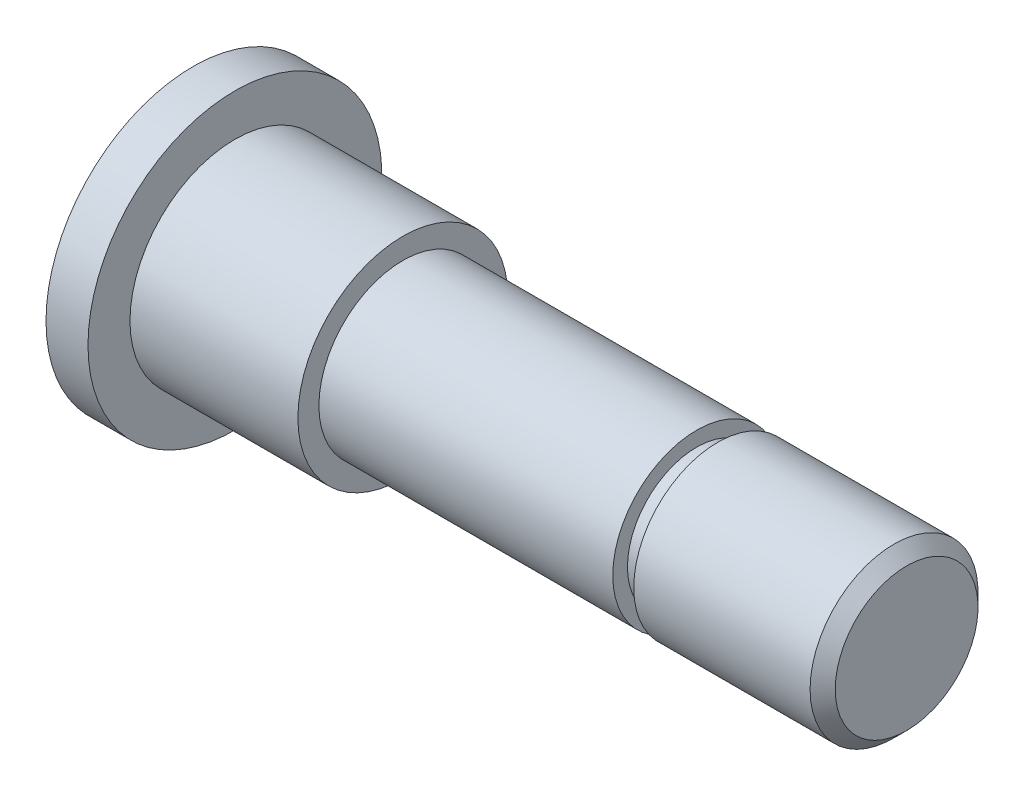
ISO-10303-21;
HEADER;
FILE_DESCRIPTION(('STEP AP214'),'2;1');
FILE_NAME('part.step','',(''),(''),'','','');
FILE_SCHEMA(('AUTOMOTIVE_DESIGN { 1 0 10303 214 1 1 1 1 }'));
ENDSEC;
DATA;
#1=APPLICATION_CONTEXT('core data for automotive mechanical design processes');
#2=APPLICATION_PROTOCOL_DEFINITION('international standard','automotive_design',2000,#1);
#3=PRODUCT_CONTEXT('',#1,'mechanical');
#4=PRODUCT('Part','Part','',(#3));
#5=PRODUCT_RELATED_PRODUCT_CATEGORY('part','',(#4));
#6=PRODUCT_DEFINITION_FORMATION('','',#4);
#7=PRODUCT_DEFINITION_CONTEXT('part definition',#1,'design');
#8=PRODUCT_DEFINITION('design','',#6,#7);
#9=PRODUCT_DEFINITION_SHAPE('','',#8);
#10=(LENGTH_UNIT() NAMED_UNIT(*) SI_UNIT(.MILLI.,.METRE.));
#11=(NAMED_UNIT(*) PLANE_ANGLE_UNIT() SI_UNIT($,.RADIAN.));
#12=(NAMED_UNIT(*) SI_UNIT($,.STERADIAN.) SOLID_ANGLE_UNIT());
#13=UNCERTAINTY_MEASURE_WITH_UNIT(LENGTH_MEASURE(1.E-05),#10,'distance_accuracy_value','');
#14=(GEOMETRIC_REPRESENTATION_CONTEXT(3) GLOBAL_UNCERTAINTY_ASSIGNED_CONTEXT((#13)) GLOBAL_UNIT_ASSIGNED_CONTEXT((#10,
#11,#12)) REPRESENTATION_CONTEXT('',''));
#15=CARTESIAN_POINT('',(0.,0.,0.));
#16=DIRECTION('',(0.,0.,1.));
#17=DIRECTION('',(1.,0.,0.));
#18=AXIS2_PLACEMENT_3D('',#15,#16,#17);
#19=CARTESIAN_POINT('',(0.,0.,0.));
#20=DIRECTION('',(1.,0.,0.));
#21=DIRECTION('',(0.,0.,-1.));
#22=AXIS2_PLACEMENT_3D('',#19,#20,#21);
#23=PLANE('',#22);
#24=CARTESIAN_POINT('',(0.,0.,0.));
#25=DIRECTION('',(-1.,0.,0.));
#26=DIRECTION('',(0.,0.,1.));
#27=AXIS2_PLACEMENT_3D('',#24,#25,#26);
#28=CIRCLE('',#27,7.);
#29=CARTESIAN_POINT('',(0.,0.,7.));
#30=VERTEX_POINT('',#29);
#31=EDGE_CURVE('E40',#30,#30,#28,.T.);
#32=ORIENTED_EDGE('',*,*,#31,.T.);
#33=EDGE_LOOP('',(#32));
#34=FACE_BOUND('',#33,.T.);
#35=ADVANCED_FACE('F30',(#34),#23,.F.);
#36=CARTESIAN_POINT('',(-12.5747225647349,0.,0.));
#37=DIRECTION('',(-1.,0.,0.));
#38=DIRECTION('',(0.,0.,1.));
#39=AXIS2_PLACEMENT_3D('',#36,#37,#38);
#40=CYLINDRICAL_SURFACE('',#39,7.);
#41=ORIENTED_EDGE('',*,*,#31,.F.);
#42=EDGE_LOOP('',(#41));
#43=FACE_BOUND('',#42,.T.);
#44=CARTESIAN_POINT('',(2.,0.,0.));
#45=DIRECTION('',(-1.,0.,0.));
#46=DIRECTION('',(0.,0.,1.));
#47=AXIS2_PLACEMENT_3D('',#44,#45,#46);
#48=CIRCLE('',#47,7.);
#49=CARTESIAN_POINT('',(2.,0.,7.));
#50=VERTEX_POINT('',#49);
#51=EDGE_CURVE('E44',#50,#50,#48,.T.);
#52=ORIENTED_EDGE('',*,*,#51,.T.);
#53=EDGE_LOOP('',(#52));
#54=FACE_BOUND('',#53,.T.);
#55=ADVANCED_FACE('F87',(#43,#54),#40,.T.);
#56=CARTESIAN_POINT('',(2.,7.,0.));
#57=DIRECTION('',(-1.,0.,0.));
#58=DIRECTION('',(0.,0.,1.));
#59=AXIS2_PLACEMENT_3D('',#56,#57,#58);
#60=PLANE('',#59);
#61=ORIENTED_EDGE('',*,*,#51,.F.);
#62=EDGE_LOOP('',(#61));
#63=FACE_BOUND('',#62,.T.);
#64=CARTESIAN_POINT('',(2.,0.,0.));
#65=DIRECTION('',(-1.,0.,0.));
#66=DIRECTION('',(0.,0.,1.));
#67=AXIS2_PLACEMENT_3D('',#64,#65,#66);
#68=CIRCLE('',#67,5.);
#69=CARTESIAN_POINT('',(2.,0.,5.));
#70=VERTEX_POINT('',#69);
#71=EDGE_CURVE('E49',#70,#70,#68,.T.);
#72=ORIENTED_EDGE('',*,*,#71,.T.);
#73=EDGE_LOOP('',(#72));
#74=FACE_BOUND('',#73,.T.);
#75=ADVANCED_FACE('F92',(#63,#74),#60,.F.);
#76=CARTESIAN_POINT('',(-12.5747225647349,0.,0.));
#77=DIRECTION('',(-1.,0.,0.));
#78=DIRECTION('',(0.,0.,1.));
#79=AXIS2_PLACEMENT_3D('',#76,#77,#78);
#80=CYLINDRICAL_SURFACE('',#79,5.);
#81=ORIENTED_EDGE('',*,*,#71,.F.);
#82=EDGE_LOOP('',(#81));
#83=FACE_BOUND('',#82,.T.);
#84=CARTESIAN_POINT('',(10.,0.,0.));
#85=DIRECTION('',(-1.,0.,0.));
#86=DIRECTION('',(0.,0.,1.));
#87=AXIS2_PLACEMENT_3D('',#84,#85,#86);
#88=CIRCLE('',#87,5.);
#89=CARTESIAN_POINT('',(10.,0.,5.));
#90=VERTEX_POINT('',#89);
#91=EDGE_CURVE('E52',#90,#90,#88,.T.);
#92=ORIENTED_EDGE('',*,*,#91,.T.);
#93=EDGE_LOOP('',(#92));
#94=FACE_BOUND('',#93,.T.);
#95=ADVANCED_FACE('F100',(#83,#94),#80,.T.);
#96=CARTESIAN_POINT('',(10.,5.,0.));
#97=DIRECTION('',(-1.,0.,0.));
#98=DIRECTION('',(0.,0.,1.));
#99=AXIS2_PLACEMENT_3D('',#96,#97,#98);
#100=PLANE('',#99);
#101=ORIENTED_EDGE('',*,*,#91,.F.);
#102=EDGE_LOOP('',(#101));
#103=FACE_BOUND('',#102,.T.);
#104=CARTESIAN_POINT('',(10.,0.,0.));
#105=DIRECTION('',(-1.,0.,0.));
#106=DIRECTION('',(0.,0.,1.));
#107=AXIS2_PLACEMENT_3D('',#104,#105,#106);
#108=CIRCLE('',#107,4.);
#109=CARTESIAN_POINT('',(10.,0.,4.));
#110=VERTEX_POINT('',#109);
#111=EDGE_CURVE('E55',#110,#110,#108,.T.);
#112=ORIENTED_EDGE('',*,*,#111,.T.);
#113=EDGE_LOOP('',(#112));
#114=FACE_BOUND('',#113,.T.);
#115=ADVANCED_FACE('F106',(#103,#114),#100,.F.);
#116=CARTESIAN_POINT('',(-12.5747225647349,0.,0.));
#117=DIRECTION('',(-1.,0.,0.));
#118=DIRECTION('',(0.,0.,1.));
#119=AXIS2_PLACEMENT_3D('',#116,#117,#118);
#120=CYLINDRICAL_SURFACE('',#119,4.);
#121=ORIENTED_EDGE('',*,*,#111,.F.);
#122=EDGE_LOOP('',(#121));
#123=FACE_BOUND('',#122,.T.);
#124=CARTESIAN_POINT('',(24.,0.,0.));
#125=DIRECTION('',(-1.,0.,0.));
#126=DIRECTION('',(0.,0.,1.));
#127=AXIS2_PLACEMENT_3D('',#124,#125,#126);
#128=CIRCLE('',#127,4.);
#129=CARTESIAN_POINT('',(24.,0.,4.));
#130=VERTEX_POINT('',#129);
#131=EDGE_CURVE('E58',#130,#130,#128,.T.);
#132=ORIENTED_EDGE('',*,*,#131,.T.);
#133=EDGE_LOOP('',(#132));
#134=FACE_BOUND('',#133,.T.);
#135=ADVANCED_FACE('F112',(#123,#134),#120,.T.);
#136=CARTESIAN_POINT('',(24.,4.,0.));
#137=DIRECTION('',(-1.,0.,0.));
#138=DIRECTION('',(0.,0.,1.));
#139=AXIS2_PLACEMENT_3D('',#136,#137,#138);
#140=PLANE('',#139);
#141=ORIENTED_EDGE('',*,*,#131,.F.);
#142=EDGE_LOOP('',(#141));
#143=FACE_BOUND('',#142,.T.);
#144=CARTESIAN_POINT('',(24.,0.,0.));
#145=DIRECTION('',(-1.,0.,0.));
#146=DIRECTION('',(0.,0.,1.));
#147=AXIS2_PLACEMENT_3D('',#144,#145,#146);
#148=CIRCLE('',#147,3.3);
#149=CARTESIAN_POINT('',(24.,0.,3.3));
#150=VERTEX_POINT('',#149);
#151=EDGE_CURVE('E61',#150,#150,#148,.T.);
#152=ORIENTED_EDGE('',*,*,#151,.T.);
#153=EDGE_LOOP('',(#152));
#154=FACE_BOUND('',#153,.T.);
#155=ADVANCED_FACE('F118',(#143,#154),#140,.F.);
#156=CARTESIAN_POINT('',(-12.5747225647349,0.,0.));
#157=DIRECTION('',(-1.,0.,0.));
#158=DIRECTION('',(0.,0.,1.));
#159=AXIS2_PLACEMENT_3D('',#156,#157,#158);
#160=CYLINDRICAL_SURFACE('',#159,3.3);
#161=ORIENTED_EDGE('',*,*,#151,.F.);
#162=EDGE_LOOP('',(#161));
#163=FACE_BOUND('',#162,.T.);
#164=CARTESIAN_POINT('',(25.,0.,0.));
#165=DIRECTION('',(-1.,0.,0.));
#166=DIRECTION('',(0.,0.,1.));
#167=AXIS2_PLACEMENT_3D('',#164,#165,#166);
#168=CIRCLE('',#167,3.3);
#169=CARTESIAN_POINT('',(25.,0.,3.3));
#170=VERTEX_POINT('',#169);
#171=EDGE_CURVE('E64',#170,#170,#168,.T.);
#172=ORIENTED_EDGE('',*,*,#171,.T.);
#173=EDGE_LOOP('',(#172));
#174=FACE_BOUND('',#173,.T.);
#175=ADVANCED_FACE('F83',(#163,#174),#160,.T.);
#176=CARTESIAN_POINT('',(25.,3.3,0.));
#177=DIRECTION('',(1.,0.,0.));
#178=DIRECTION('',(0.,0.,-1.));
#179=AXIS2_PLACEMENT_3D('',#176,#177,#178);
#180=PLANE('',#179);
#181=ORIENTED_EDGE('',*,*,#171,.F.);
#182=EDGE_LOOP('',(#181));
#183=FACE_BOUND('',#182,.T.);
#184=CARTESIAN_POINT('',(25.,0.,0.));
#185=DIRECTION('',(-1.,0.,0.));
#186=DIRECTION('',(0.,0.,1.));
#187=AXIS2_PLACEMENT_3D('',#184,#185,#186);
#188=CIRCLE('',#187,4.);
#189=CARTESIAN_POINT('',(25.,0.,4.));
#190=VERTEX_POINT('',#189);
#191=EDGE_CURVE('E67',#190,#190,#188,.T.);
#192=ORIENTED_EDGE('',*,*,#191,.T.);
#193=EDGE_LOOP('',(#192));
#194=FACE_BOUND('',#193,.T.);
#195=ADVANCED_FACE('F71',(#183,#194),#180,.F.);
#196=CARTESIAN_POINT('',(-12.5747225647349,0.,0.));
#197=DIRECTION('',(-1.,0.,0.));
#198=DIRECTION('',(0.,0.,1.));
#199=AXIS2_PLACEMENT_3D('',#196,#197,#198);
#200=CYLINDRICAL_SURFACE('',#199,4.);
#201=CARTESIAN_POINT('',(33.4,0.,0.));
#202=DIRECTION('',(-1.,0.,0.));
#203=DIRECTION('',(0.,0.,1.));
#204=AXIS2_PLACEMENT_3D('',#201,#202,#203);
#205=CIRCLE('',#204,4.);
#206=CARTESIAN_POINT('',(33.4,0.,4.));
#207=VERTEX_POINT('',#206);
#208=EDGE_CURVE('E36',#207,#207,#205,.T.);
#209=ORIENTED_EDGE('',*,*,#208,.T.);
#210=EDGE_LOOP('',(#209));
#211=FACE_BOUND('',#210,.T.);
#212=ORIENTED_EDGE('',*,*,#191,.F.);
#213=EDGE_LOOP('',(#212));
#214=FACE_BOUND('',#213,.T.);
#215=ADVANCED_FACE('F73',(#211,#214),#200,.T.);
#216=CARTESIAN_POINT('',(34.,4.,0.));
#217=DIRECTION('',(-1.,0.,0.));
#218=DIRECTION('',(0.,0.,1.));
#219=AXIS2_PLACEMENT_3D('',#216,#217,#218);
#220=PLANE('',#219);
#221=CARTESIAN_POINT('',(34.,0.,0.));
#222=DIRECTION('',(-1.,0.,0.));
#223=DIRECTION('',(0.,0.,1.));
#224=AXIS2_PLACEMENT_3D('',#221,#222,#223);
#225=CIRCLE('',#224,3.4);
#226=CARTESIAN_POINT('',(34.,0.,3.4));
#227=VERTEX_POINT('',#226);
#228=EDGE_CURVE('E10',#227,#227,#225,.F.);
#229=ORIENTED_EDGE('',*,*,#228,.T.);
#230=EDGE_LOOP('',(#229));
#231=FACE_BOUND('',#230,.T.);
#232=ADVANCED_FACE('F75',(#231),#220,.F.);
#233=CARTESIAN_POINT('',(33.4,0.,0.));
#234=DIRECTION('',(-1.,0.,0.));
#235=DIRECTION('',(0.,0.,1.));
#236=AXIS2_PLACEMENT_3D('',#233,#234,#235);
#237=CONICAL_SURFACE('',#236,4.,0.785398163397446);
#238=ORIENTED_EDGE('',*,*,#228,.F.);
#239=EDGE_LOOP('',(#238));
#240=FACE_BOUND('',#239,.T.);
#241=ORIENTED_EDGE('',*,*,#208,.F.);
#242=EDGE_LOOP('',(#241));
#243=FACE_BOUND('',#242,.T.);
#244=ADVANCED_FACE('F81',(#240,#243),#237,.T.);
#245=CLOSED_SHELL('',(#35,#55,#75,#95,#115,#135,#155,#175,#195,#215,#232,#244));
#246=MANIFOLD_SOLID_BREP('B2',#245);
#247=ADVANCED_BREP_SHAPE_REPRESENTATION('',(#18,#246),#14);
#248=SHAPE_DEFINITION_REPRESENTATION(#9,#247);
ENDSEC;
END-ISO-10303-21;
